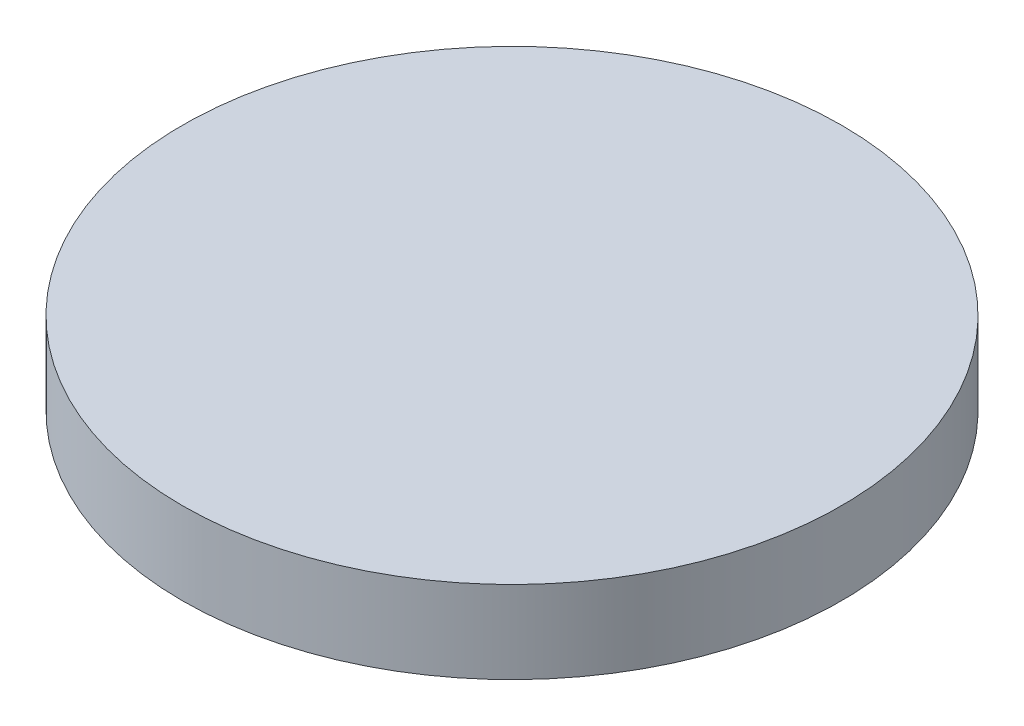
from build123d import *

# Parameters (mm, degrees)
SKETCH1_R           = 40
BOSS_EXTRUDE1_DEPTH = 10


with BuildPart() as part:
    # Sketch1 → Boss-Extrude1 (new body)
    with BuildSketch(Plane(origin=(0, 0, 0), x_dir=(1, 0, 0), z_dir=(0, 1, 0))):
        with Locations(Location((0, 0, 0), (0, 0, 270))):
            Circle(SKETCH1_R)
    extrude(amount=BOSS_EXTRUDE1_DEPTH)


solid = part.part
